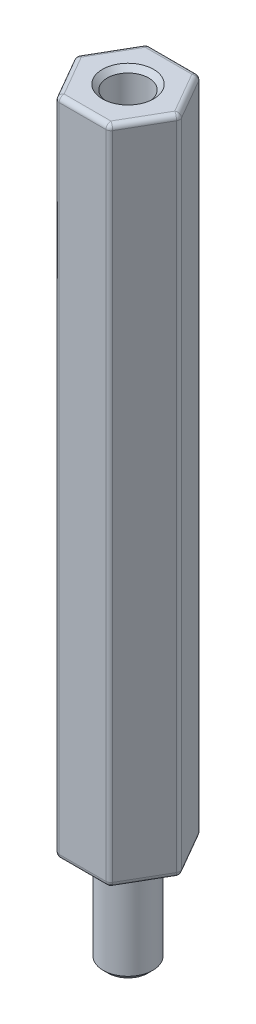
ISO-10303-21;
HEADER;
FILE_DESCRIPTION(('STEP AP214'),'2;1');
FILE_NAME('part.step','',(''),(''),'','','');
FILE_SCHEMA(('AUTOMOTIVE_DESIGN { 1 0 10303 214 1 1 1 1 }'));
ENDSEC;
DATA;
#1=APPLICATION_CONTEXT('core data for automotive mechanical design processes');
#2=APPLICATION_PROTOCOL_DEFINITION('international standard','automotive_design',2000,#1);
#3=PRODUCT_CONTEXT('',#1,'mechanical');
#4=PRODUCT('Part','Part','',(#3));
#5=PRODUCT_RELATED_PRODUCT_CATEGORY('part','',(#4));
#6=PRODUCT_DEFINITION_FORMATION('','',#4);
#7=PRODUCT_DEFINITION_CONTEXT('part definition',#1,'design');
#8=PRODUCT_DEFINITION('design','',#6,#7);
#9=PRODUCT_DEFINITION_SHAPE('','',#8);
#10=(LENGTH_UNIT() NAMED_UNIT(*) SI_UNIT(.MILLI.,.METRE.));
#11=(NAMED_UNIT(*) PLANE_ANGLE_UNIT() SI_UNIT($,.RADIAN.));
#12=(NAMED_UNIT(*) SI_UNIT($,.STERADIAN.) SOLID_ANGLE_UNIT());
#13=UNCERTAINTY_MEASURE_WITH_UNIT(LENGTH_MEASURE(1.E-05),#10,'distance_accuracy_value','');
#14=(GEOMETRIC_REPRESENTATION_CONTEXT(3) GLOBAL_UNCERTAINTY_ASSIGNED_CONTEXT((#13)) GLOBAL_UNIT_ASSIGNED_CONTEXT((#10,
#11,#12)) REPRESENTATION_CONTEXT('',''));
#15=CARTESIAN_POINT('',(0.,0.,0.));
#16=DIRECTION('',(0.,0.,1.));
#17=DIRECTION('',(1.,0.,0.));
#18=AXIS2_PLACEMENT_3D('',#15,#16,#17);
#19=CARTESIAN_POINT('',(0.,40.,0.));
#20=DIRECTION('',(0.,1.,0.));
#21=DIRECTION('',(0.,0.,1.));
#22=AXIS2_PLACEMENT_3D('',#19,#20,#21);
#23=PLANE('',#22);
#24=CARTESIAN_POINT('',(0.,40.,0.));
#25=DIRECTION('',(0.,1.,0.));
#26=DIRECTION('',(0.,0.,1.));
#27=AXIS2_PLACEMENT_3D('',#24,#25,#26);
#28=CIRCLE('',#27,1.55000000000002);
#29=CARTESIAN_POINT('',(0.,40.,1.55000000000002));
#30=VERTEX_POINT('',#29);
#31=EDGE_CURVE('E288',#30,#30,#28,.F.);
#32=ORIENTED_EDGE('',*,*,#31,.T.);
#33=EDGE_LOOP('',(#32));
#34=FACE_BOUND('',#33,.T.);
#35=DIRECTION('',(-0.5,0.,0.866025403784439));
#36=VECTOR('',#35,1.);
#37=CARTESIAN_POINT('',(-2.82901631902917,40.,0.));
#38=LINE('',#37,#36);
#39=CARTESIAN_POINT('',(-1.41450815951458,40.,-2.45));
#40=VERTEX_POINT('',#39);
#41=CARTESIAN_POINT('',(-2.82901631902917,40.,0.));
#42=VERTEX_POINT('',#41);
#43=EDGE_CURVE('E62',#40,#42,#38,.T.);
#44=ORIENTED_EDGE('',*,*,#43,.T.);
#45=DIRECTION('',(0.5,0.,0.866025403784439));
#46=VECTOR('',#45,1.);
#47=CARTESIAN_POINT('',(-1.41450815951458,40.,2.45));
#48=LINE('',#47,#46);
#49=CARTESIAN_POINT('',(-1.41450815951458,40.,2.45));
#50=VERTEX_POINT('',#49);
#51=EDGE_CURVE('E571',#42,#50,#48,.T.);
#52=ORIENTED_EDGE('',*,*,#51,.T.);
#53=DIRECTION('',(1.,0.,0.));
#54=VECTOR('',#53,1.);
#55=CARTESIAN_POINT('',(1.41450815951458,40.,2.45));
#56=LINE('',#55,#54);
#57=CARTESIAN_POINT('',(1.41450815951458,40.,2.45));
#58=VERTEX_POINT('',#57);
#59=EDGE_CURVE('E563',#50,#58,#56,.T.);
#60=ORIENTED_EDGE('',*,*,#59,.T.);
#61=DIRECTION('',(0.5,0.,-0.866025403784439));
#62=VECTOR('',#61,1.);
#63=CARTESIAN_POINT('',(2.82901631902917,40.,0.));
#64=LINE('',#63,#62);
#65=CARTESIAN_POINT('',(2.82901631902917,40.,0.));
#66=VERTEX_POINT('',#65);
#67=EDGE_CURVE('E565',#58,#66,#64,.T.);
#68=ORIENTED_EDGE('',*,*,#67,.T.);
#69=DIRECTION('',(-0.5,0.,-0.866025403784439));
#70=VECTOR('',#69,1.);
#71=CARTESIAN_POINT('',(1.41450815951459,40.,-2.45));
#72=LINE('',#71,#70);
#73=CARTESIAN_POINT('',(1.41450815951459,40.,-2.45));
#74=VERTEX_POINT('',#73);
#75=EDGE_CURVE('E567',#66,#74,#72,.T.);
#76=ORIENTED_EDGE('',*,*,#75,.T.);
#77=DIRECTION('',(-1.,0.,0.));
#78=VECTOR('',#77,1.);
#79=CARTESIAN_POINT('',(-1.41450815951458,40.,-2.45));
#80=LINE('',#79,#78);
#81=EDGE_CURVE('E67',#74,#40,#80,.T.);
#82=ORIENTED_EDGE('',*,*,#81,.T.);
#83=EDGE_LOOP('',(#44,#52,#60,#68,#76,#82));
#84=FACE_BOUND('',#83,.T.);
#85=ADVANCED_FACE('F47',(#34,#84),#23,.T.);
#86=CARTESIAN_POINT('',(0.,0.,0.));
#87=DIRECTION('',(0.,1.,0.));
#88=DIRECTION('',(0.,0.,1.));
#89=AXIS2_PLACEMENT_3D('',#86,#87,#88);
#90=PLANE('',#89);
#91=CARTESIAN_POINT('',(0.,0.,0.));
#92=DIRECTION('',(0.,1.,0.));
#93=DIRECTION('',(0.,0.,1.));
#94=AXIS2_PLACEMENT_3D('',#91,#92,#93);
#95=CIRCLE('',#94,1.8);
#96=CARTESIAN_POINT('',(0.,0.,1.8));
#97=VERTEX_POINT('',#96);
#98=EDGE_CURVE('E11',#97,#97,#95,.T.);
#99=ORIENTED_EDGE('',*,*,#98,.T.);
#100=EDGE_LOOP('',(#99));
#101=FACE_BOUND('',#100,.T.);
#102=DIRECTION('',(1.,0.,0.));
#103=VECTOR('',#102,1.);
#104=CARTESIAN_POINT('',(0.,0.,2.45));
#105=LINE('',#104,#103);
#106=CARTESIAN_POINT('',(1.41450815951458,0.,2.45));
#107=VERTEX_POINT('',#106);
#108=CARTESIAN_POINT('',(-1.41450815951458,0.,2.45));
#109=VERTEX_POINT('',#108);
#110=EDGE_CURVE('E182',#107,#109,#105,.F.);
#111=ORIENTED_EDGE('',*,*,#110,.T.);
#112=DIRECTION('',(0.5,0.,0.866025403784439));
#113=VECTOR('',#112,1.);
#114=CARTESIAN_POINT('',(-2.12176223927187,0.,1.225));
#115=LINE('',#114,#113);
#116=CARTESIAN_POINT('',(-2.82901631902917,0.,0.));
#117=VERTEX_POINT('',#116);
#118=EDGE_CURVE('E208',#109,#117,#115,.F.);
#119=ORIENTED_EDGE('',*,*,#118,.T.);
#120=DIRECTION('',(-0.5,0.,0.866025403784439));
#121=VECTOR('',#120,1.);
#122=CARTESIAN_POINT('',(-2.12176223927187,0.,-1.225));
#123=LINE('',#122,#121);
#124=CARTESIAN_POINT('',(-1.41450815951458,0.,-2.45));
#125=VERTEX_POINT('',#124);
#126=EDGE_CURVE('E524',#117,#125,#123,.F.);
#127=ORIENTED_EDGE('',*,*,#126,.T.);
#128=DIRECTION('',(-1.,0.,0.));
#129=VECTOR('',#128,1.);
#130=CARTESIAN_POINT('',(0.,0.,-2.45));
#131=LINE('',#130,#129);
#132=CARTESIAN_POINT('',(1.41450815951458,0.,-2.45));
#133=VERTEX_POINT('',#132);
#134=EDGE_CURVE('E522',#125,#133,#131,.F.);
#135=ORIENTED_EDGE('',*,*,#134,.T.);
#136=DIRECTION('',(-0.5,0.,-0.866025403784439));
#137=VECTOR('',#136,1.);
#138=CARTESIAN_POINT('',(2.12176223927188,0.,-1.225));
#139=LINE('',#138,#137);
#140=CARTESIAN_POINT('',(2.82901631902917,0.,0.));
#141=VERTEX_POINT('',#140);
#142=EDGE_CURVE('E520',#133,#141,#139,.F.);
#143=ORIENTED_EDGE('',*,*,#142,.T.);
#144=DIRECTION('',(0.5,0.,-0.866025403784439));
#145=VECTOR('',#144,1.);
#146=CARTESIAN_POINT('',(2.12176223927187,0.,1.225));
#147=LINE('',#146,#145);
#148=EDGE_CURVE('E518',#141,#107,#147,.F.);
#149=ORIENTED_EDGE('',*,*,#148,.T.);
#150=EDGE_LOOP('',(#111,#119,#127,#135,#143,#149));
#151=FACE_BOUND('',#150,.T.);
#152=ADVANCED_FACE('F307',(#101,#151),#90,.F.);
#153=CARTESIAN_POINT('',(1.58771324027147,40.,-2.75));
#154=DIRECTION('',(0.,0.,1.));
#155=DIRECTION('',(1.,0.,0.));
#156=AXIS2_PLACEMENT_3D('',#153,#154,#155);
#157=PLANE('',#156);
#158=DIRECTION('',(0.,-1.,0.));
#159=VECTOR('',#158,1.);
#160=CARTESIAN_POINT('',(1.41450815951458,40.,-2.75));
#161=LINE('',#160,#159);
#162=CARTESIAN_POINT('',(1.41450815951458,39.7,-2.75));
#163=VERTEX_POINT('',#162);
#164=CARTESIAN_POINT('',(1.41450815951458,0.300000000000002,-2.75));
#165=VERTEX_POINT('',#164);
#166=EDGE_CURVE('E487',#163,#165,#161,.T.);
#167=ORIENTED_EDGE('',*,*,#166,.T.);
#168=DIRECTION('',(-1.,0.,0.));
#169=VECTOR('',#168,1.);
#170=CARTESIAN_POINT('',(1.58771324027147,0.300000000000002,-2.75));
#171=LINE('',#170,#169);
#172=CARTESIAN_POINT('',(-1.41450815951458,0.300000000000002,-2.75));
#173=VERTEX_POINT('',#172);
#174=EDGE_CURVE('E541',#165,#173,#171,.T.);
#175=ORIENTED_EDGE('',*,*,#174,.T.);
#176=DIRECTION('',(0.,-1.,0.));
#177=VECTOR('',#176,1.);
#178=CARTESIAN_POINT('',(-1.41450815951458,40.,-2.75));
#179=LINE('',#178,#177);
#180=CARTESIAN_POINT('',(-1.41450815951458,39.7,-2.75));
#181=VERTEX_POINT('',#180);
#182=EDGE_CURVE('E484',#173,#181,#179,.F.);
#183=ORIENTED_EDGE('',*,*,#182,.T.);
#184=DIRECTION('',(-1.,0.,0.));
#185=VECTOR('',#184,1.);
#186=CARTESIAN_POINT('',(1.41450815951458,39.7,-2.75));
#187=LINE('',#186,#185);
#188=EDGE_CURVE('E539',#181,#163,#187,.F.);
#189=ORIENTED_EDGE('',*,*,#188,.T.);
#190=EDGE_LOOP('',(#167,#175,#183,#189));
#191=FACE_BOUND('',#190,.T.);
#192=ADVANCED_FACE('F315',(#191),#157,.F.);
#193=CARTESIAN_POINT('',(-1.58771324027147,40.,-2.75));
#194=DIRECTION('',(0.866025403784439,0.,0.5));
#195=DIRECTION('',(0.5,0.,-0.866025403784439));
#196=AXIS2_PLACEMENT_3D('',#193,#194,#195);
#197=PLANE('',#196);
#198=DIRECTION('',(0.,-1.,0.));
#199=VECTOR('',#198,1.);
#200=CARTESIAN_POINT('',(-1.67431578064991,40.,-2.6));
#201=LINE('',#200,#199);
#202=CARTESIAN_POINT('',(-1.67431578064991,39.7,-2.6));
#203=VERTEX_POINT('',#202);
#204=CARTESIAN_POINT('',(-1.67431578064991,0.300000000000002,-2.6));
#205=VERTEX_POINT('',#204);
#206=EDGE_CURVE('E195',#203,#205,#201,.T.);
#207=ORIENTED_EDGE('',*,*,#206,.T.);
#208=DIRECTION('',(-0.5,0.,0.866025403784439));
#209=VECTOR('',#208,1.);
#210=CARTESIAN_POINT('',(-1.58771324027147,0.300000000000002,-2.75));
#211=LINE('',#210,#209);
#212=CARTESIAN_POINT('',(-3.0888239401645,0.300000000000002,-0.15));
#213=VERTEX_POINT('',#212);
#214=EDGE_CURVE('E533',#205,#213,#211,.T.);
#215=ORIENTED_EDGE('',*,*,#214,.T.);
#216=DIRECTION('',(0.,-1.,0.));
#217=VECTOR('',#216,1.);
#218=CARTESIAN_POINT('',(-3.0888239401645,40.,-0.15));
#219=LINE('',#218,#217);
#220=CARTESIAN_POINT('',(-3.0888239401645,39.7,-0.15));
#221=VERTEX_POINT('',#220);
#222=EDGE_CURVE('E504',#213,#221,#219,.F.);
#223=ORIENTED_EDGE('',*,*,#222,.T.);
#224=DIRECTION('',(-0.5,0.,0.866025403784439));
#225=VECTOR('',#224,1.);
#226=CARTESIAN_POINT('',(-1.67431578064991,39.7,-2.6));
#227=LINE('',#226,#225);
#228=EDGE_CURVE('E531',#221,#203,#227,.F.);
#229=ORIENTED_EDGE('',*,*,#228,.T.);
#230=EDGE_LOOP('',(#207,#215,#223,#229));
#231=FACE_BOUND('',#230,.T.);
#232=ADVANCED_FACE('F336',(#231),#197,.F.);
#233=CARTESIAN_POINT('',(-3.17542648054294,40.,0.));
#234=DIRECTION('',(0.866025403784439,0.,-0.5));
#235=DIRECTION('',(-0.5,0.,-0.866025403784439));
#236=AXIS2_PLACEMENT_3D('',#233,#234,#235);
#237=PLANE('',#236);
#238=DIRECTION('',(0.,-1.,0.));
#239=VECTOR('',#238,1.);
#240=CARTESIAN_POINT('',(-3.0888239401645,40.,0.149999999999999));
#241=LINE('',#240,#239);
#242=CARTESIAN_POINT('',(-3.0888239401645,39.7,0.149999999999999));
#243=VERTEX_POINT('',#242);
#244=CARTESIAN_POINT('',(-3.0888239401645,0.300000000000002,0.149999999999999));
#245=VERTEX_POINT('',#244);
#246=EDGE_CURVE('E178',#243,#245,#241,.T.);
#247=ORIENTED_EDGE('',*,*,#246,.T.);
#248=DIRECTION('',(0.5,0.,0.866025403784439));
#249=VECTOR('',#248,1.);
#250=CARTESIAN_POINT('',(-3.17542648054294,0.300000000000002,0.));
#251=LINE('',#250,#249);
#252=CARTESIAN_POINT('',(-1.67431578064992,0.300000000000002,2.6));
#253=VERTEX_POINT('',#252);
#254=EDGE_CURVE('E173',#245,#253,#251,.T.);
#255=ORIENTED_EDGE('',*,*,#254,.T.);
#256=DIRECTION('',(0.,-1.,0.));
#257=VECTOR('',#256,1.);
#258=CARTESIAN_POINT('',(-1.67431578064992,40.,2.6));
#259=LINE('',#258,#257);
#260=CARTESIAN_POINT('',(-1.67431578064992,39.7,2.6));
#261=VERTEX_POINT('',#260);
#262=EDGE_CURVE('E176',#253,#261,#259,.F.);
#263=ORIENTED_EDGE('',*,*,#262,.T.);
#264=DIRECTION('',(0.5,0.,0.866025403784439));
#265=VECTOR('',#264,1.);
#266=CARTESIAN_POINT('',(-3.0888239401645,39.7,0.149999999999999));
#267=LINE('',#266,#265);
#268=EDGE_CURVE('E183',#261,#243,#267,.F.);
#269=ORIENTED_EDGE('',*,*,#268,.T.);
#270=EDGE_LOOP('',(#247,#255,#263,#269));
#271=FACE_BOUND('',#270,.T.);
#272=ADVANCED_FACE('F175',(#271),#237,.F.);
#273=CARTESIAN_POINT('',(-1.58771324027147,40.,2.75));
#274=DIRECTION('',(0.,0.,-1.));
#275=DIRECTION('',(-1.,0.,0.));
#276=AXIS2_PLACEMENT_3D('',#273,#274,#275);
#277=PLANE('',#276);
#278=DIRECTION('',(0.,-1.,0.));
#279=VECTOR('',#278,1.);
#280=CARTESIAN_POINT('',(-1.41450815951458,40.,2.75));
#281=LINE('',#280,#279);
#282=CARTESIAN_POINT('',(-1.41450815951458,39.7,2.75));
#283=VERTEX_POINT('',#282);
#284=CARTESIAN_POINT('',(-1.41450815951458,0.300000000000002,2.75));
#285=VERTEX_POINT('',#284);
#286=EDGE_CURVE('E513',#283,#285,#281,.T.);
#287=ORIENTED_EDGE('',*,*,#286,.T.);
#288=DIRECTION('',(1.,0.,0.));
#289=VECTOR('',#288,1.);
#290=CARTESIAN_POINT('',(-1.58771324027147,0.300000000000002,2.75));
#291=LINE('',#290,#289);
#292=CARTESIAN_POINT('',(1.41450815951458,0.300000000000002,2.75));
#293=VERTEX_POINT('',#292);
#294=EDGE_CURVE('E217',#285,#293,#291,.T.);
#295=ORIENTED_EDGE('',*,*,#294,.T.);
#296=DIRECTION('',(0.,-1.,0.));
#297=VECTOR('',#296,1.);
#298=CARTESIAN_POINT('',(1.41450815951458,40.,2.75));
#299=LINE('',#298,#297);
#300=CARTESIAN_POINT('',(1.41450815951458,39.7,2.75));
#301=VERTEX_POINT('',#300);
#302=EDGE_CURVE('E510',#293,#301,#299,.F.);
#303=ORIENTED_EDGE('',*,*,#302,.T.);
#304=DIRECTION('',(1.,0.,0.));
#305=VECTOR('',#304,1.);
#306=CARTESIAN_POINT('',(-1.41450815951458,39.7,2.75));
#307=LINE('',#306,#305);
#308=EDGE_CURVE('E572',#301,#283,#307,.F.);
#309=ORIENTED_EDGE('',*,*,#308,.T.);
#310=EDGE_LOOP('',(#287,#295,#303,#309));
#311=FACE_BOUND('',#310,.T.);
#312=ADVANCED_FACE('F329',(#311),#277,.F.);
#313=CARTESIAN_POINT('',(1.58771324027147,40.,2.75));
#314=DIRECTION('',(-0.866025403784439,0.,-0.5));
#315=DIRECTION('',(-0.5,0.,0.866025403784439));
#316=AXIS2_PLACEMENT_3D('',#313,#314,#315);
#317=PLANE('',#316);
#318=DIRECTION('',(0.,-1.,0.));
#319=VECTOR('',#318,1.);
#320=CARTESIAN_POINT('',(1.67431578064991,40.,2.6));
#321=LINE('',#320,#319);
#322=CARTESIAN_POINT('',(1.67431578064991,39.7,2.6));
#323=VERTEX_POINT('',#322);
#324=CARTESIAN_POINT('',(1.67431578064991,0.300000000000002,2.6));
#325=VERTEX_POINT('',#324);
#326=EDGE_CURVE('E498',#323,#325,#321,.T.);
#327=ORIENTED_EDGE('',*,*,#326,.T.);
#328=DIRECTION('',(0.5,0.,-0.866025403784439));
#329=VECTOR('',#328,1.);
#330=CARTESIAN_POINT('',(1.58771324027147,0.300000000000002,2.75));
#331=LINE('',#330,#329);
#332=CARTESIAN_POINT('',(3.0888239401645,0.300000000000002,0.149999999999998));
#333=VERTEX_POINT('',#332);
#334=EDGE_CURVE('E557',#325,#333,#331,.T.);
#335=ORIENTED_EDGE('',*,*,#334,.T.);
#336=DIRECTION('',(0.,-1.,0.));
#337=VECTOR('',#336,1.);
#338=CARTESIAN_POINT('',(3.0888239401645,40.,0.149999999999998));
#339=LINE('',#338,#337);
#340=CARTESIAN_POINT('',(3.0888239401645,39.7,0.149999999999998));
#341=VERTEX_POINT('',#340);
#342=EDGE_CURVE('E501',#333,#341,#339,.F.);
#343=ORIENTED_EDGE('',*,*,#342,.T.);
#344=DIRECTION('',(0.5,0.,-0.866025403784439));
#345=VECTOR('',#344,1.);
#346=CARTESIAN_POINT('',(1.67431578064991,39.7,2.6));
#347=LINE('',#346,#345);
#348=EDGE_CURVE('E555',#341,#323,#347,.F.);
#349=ORIENTED_EDGE('',*,*,#348,.T.);
#350=EDGE_LOOP('',(#327,#335,#343,#349));
#351=FACE_BOUND('',#350,.T.);
#352=ADVANCED_FACE('F325',(#351),#317,.F.);
#353=CARTESIAN_POINT('',(3.17542648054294,40.,0.));
#354=DIRECTION('',(-0.866025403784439,0.,0.5));
#355=DIRECTION('',(0.5,0.,0.866025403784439));
#356=AXIS2_PLACEMENT_3D('',#353,#354,#355);
#357=PLANE('',#356);
#358=DIRECTION('',(0.,-1.,0.));
#359=VECTOR('',#358,1.);
#360=CARTESIAN_POINT('',(3.0888239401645,40.,-0.150000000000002));
#361=LINE('',#360,#359);
#362=CARTESIAN_POINT('',(3.0888239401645,39.7,-0.150000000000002));
#363=VERTEX_POINT('',#362);
#364=CARTESIAN_POINT('',(3.0888239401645,0.300000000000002,-0.150000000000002));
#365=VERTEX_POINT('',#364);
#366=EDGE_CURVE('E492',#363,#365,#361,.T.);
#367=ORIENTED_EDGE('',*,*,#366,.T.);
#368=DIRECTION('',(-0.5,0.,-0.866025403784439));
#369=VECTOR('',#368,1.);
#370=CARTESIAN_POINT('',(3.17542648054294,0.300000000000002,0.));
#371=LINE('',#370,#369);
#372=CARTESIAN_POINT('',(1.67431578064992,0.300000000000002,-2.6));
#373=VERTEX_POINT('',#372);
#374=EDGE_CURVE('E549',#365,#373,#371,.T.);
#375=ORIENTED_EDGE('',*,*,#374,.T.);
#376=DIRECTION('',(0.,-1.,0.));
#377=VECTOR('',#376,1.);
#378=CARTESIAN_POINT('',(1.67431578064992,40.,-2.6));
#379=LINE('',#378,#377);
#380=CARTESIAN_POINT('',(1.67431578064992,39.7,-2.6));
#381=VERTEX_POINT('',#380);
#382=EDGE_CURVE('E495',#373,#381,#379,.F.);
#383=ORIENTED_EDGE('',*,*,#382,.T.);
#384=DIRECTION('',(-0.5,0.,-0.866025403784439));
#385=VECTOR('',#384,1.);
#386=CARTESIAN_POINT('',(3.0888239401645,39.7,-0.150000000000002));
#387=LINE('',#386,#385);
#388=EDGE_CURVE('E547',#381,#363,#387,.F.);
#389=ORIENTED_EDGE('',*,*,#388,.T.);
#390=EDGE_LOOP('',(#367,#375,#383,#389));
#391=FACE_BOUND('',#390,.T.);
#392=ADVANCED_FACE('F322',(#391),#357,.F.);
#393=CARTESIAN_POINT('',(0.,40.,0.));
#394=DIRECTION('',(0.,-1.,0.));
#395=DIRECTION('',(0.,0.,-1.));
#396=AXIS2_PLACEMENT_3D('',#393,#394,#395);
#397=CYLINDRICAL_SURFACE('',#396,1.25);
#398=CARTESIAN_POINT('',(0.,39.7,0.));
#399=DIRECTION('',(0.,1.,0.));
#400=DIRECTION('',(0.,0.,1.));
#401=AXIS2_PLACEMENT_3D('',#398,#399,#400);
#402=CIRCLE('',#401,1.25);
#403=CARTESIAN_POINT('',(0.,39.7,1.25));
#404=VERTEX_POINT('',#403);
#405=EDGE_CURVE('E285',#404,#404,#402,.T.);
#406=ORIENTED_EDGE('',*,*,#405,.T.);
#407=EDGE_LOOP('',(#406));
#408=FACE_BOUND('',#407,.T.);
#409=CARTESIAN_POINT('',(0.,0.,0.));
#410=DIRECTION('',(0.,1.,0.));
#411=DIRECTION('',(0.,0.,1.));
#412=AXIS2_PLACEMENT_3D('',#409,#410,#411);
#413=CIRCLE('',#412,1.25);
#414=CARTESIAN_POINT('',(0.,0.,1.25));
#415=VERTEX_POINT('',#414);
#416=EDGE_CURVE('E248',#415,#415,#413,.T.);
#417=ORIENTED_EDGE('',*,*,#416,.F.);
#418=EDGE_LOOP('',(#417));
#419=FACE_BOUND('',#418,.T.);
#420=ADVANCED_FACE('F319',(#408,#419),#397,.F.);
#421=CARTESIAN_POINT('',(1.41450815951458,40.,-2.45));
#422=DIRECTION('',(0.,-1.,0.));
#423=DIRECTION('',(0.,0.,-1.));
#424=AXIS2_PLACEMENT_3D('',#421,#422,#423);
#425=CYLINDRICAL_SURFACE('',#424,0.3);
#426=ORIENTED_EDGE('',*,*,#382,.F.);
#427=CARTESIAN_POINT('',(1.41450815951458,0.300000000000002,-2.45));
#428=DIRECTION('',(0.,-1.,0.));
#429=DIRECTION('',(0.,0.,-1.));
#430=AXIS2_PLACEMENT_3D('',#427,#428,#429);
#431=CIRCLE('',#430,0.3);
#432=EDGE_CURVE('E545',#373,#165,#431,.F.);
#433=ORIENTED_EDGE('',*,*,#432,.T.);
#434=ORIENTED_EDGE('',*,*,#166,.F.);
#435=CARTESIAN_POINT('',(1.41450815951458,39.7,-2.45));
#436=DIRECTION('',(0.,-1.,0.));
#437=DIRECTION('',(0.,0.,-1.));
#438=AXIS2_PLACEMENT_3D('',#435,#436,#437);
#439=CIRCLE('',#438,0.3);
#440=EDGE_CURVE('E543',#163,#381,#439,.T.);
#441=ORIENTED_EDGE('',*,*,#440,.T.);
#442=EDGE_LOOP('',(#426,#433,#434,#441));
#443=FACE_BOUND('',#442,.T.);
#444=ADVANCED_FACE('F343',(#443),#425,.T.);
#445=CARTESIAN_POINT('',(2.82901631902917,40.,0.));
#446=DIRECTION('',(0.,-1.,0.));
#447=DIRECTION('',(0.,0.,-1.));
#448=AXIS2_PLACEMENT_3D('',#445,#446,#447);
#449=CYLINDRICAL_SURFACE('',#448,0.3);
#450=ORIENTED_EDGE('',*,*,#342,.F.);
#451=CARTESIAN_POINT('',(2.82901631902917,0.300000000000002,0.));
#452=DIRECTION('',(0.,-1.,0.));
#453=DIRECTION('',(0.,0.,-1.));
#454=AXIS2_PLACEMENT_3D('',#451,#452,#453);
#455=CIRCLE('',#454,0.3);
#456=EDGE_CURVE('E553',#333,#365,#455,.F.);
#457=ORIENTED_EDGE('',*,*,#456,.T.);
#458=ORIENTED_EDGE('',*,*,#366,.F.);
#459=CARTESIAN_POINT('',(2.82901631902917,39.7,0.));
#460=DIRECTION('',(0.,-1.,0.));
#461=DIRECTION('',(0.,0.,-1.));
#462=AXIS2_PLACEMENT_3D('',#459,#460,#461);
#463=CIRCLE('',#462,0.3);
#464=EDGE_CURVE('E551',#363,#341,#463,.T.);
#465=ORIENTED_EDGE('',*,*,#464,.T.);
#466=EDGE_LOOP('',(#450,#457,#458,#465));
#467=FACE_BOUND('',#466,.T.);
#468=ADVANCED_FACE('F346',(#467),#449,.T.);
#469=CARTESIAN_POINT('',(-1.41450815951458,40.,-2.45));
#470=DIRECTION('',(0.,-1.,0.));
#471=DIRECTION('',(0.,0.,-1.));
#472=AXIS2_PLACEMENT_3D('',#469,#470,#471);
#473=CYLINDRICAL_SURFACE('',#472,0.3);
#474=ORIENTED_EDGE('',*,*,#182,.F.);
#475=CARTESIAN_POINT('',(-1.41450815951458,0.300000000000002,-2.45));
#476=DIRECTION('',(0.,-1.,0.));
#477=DIRECTION('',(0.,0.,-1.));
#478=AXIS2_PLACEMENT_3D('',#475,#476,#477);
#479=CIRCLE('',#478,0.3);
#480=EDGE_CURVE('E537',#173,#205,#479,.F.);
#481=ORIENTED_EDGE('',*,*,#480,.T.);
#482=ORIENTED_EDGE('',*,*,#206,.F.);
#483=CARTESIAN_POINT('',(-1.41450815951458,39.7,-2.45));
#484=DIRECTION('',(0.,-1.,0.));
#485=DIRECTION('',(0.,0.,-1.));
#486=AXIS2_PLACEMENT_3D('',#483,#484,#485);
#487=CIRCLE('',#486,0.3);
#488=EDGE_CURVE('E535',#203,#181,#487,.T.);
#489=ORIENTED_EDGE('',*,*,#488,.T.);
#490=EDGE_LOOP('',(#474,#481,#482,#489));
#491=FACE_BOUND('',#490,.T.);
#492=ADVANCED_FACE('F350',(#491),#473,.T.);
#493=CARTESIAN_POINT('',(-2.82901631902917,40.,0.));
#494=DIRECTION('',(0.,-1.,0.));
#495=DIRECTION('',(0.,0.,-1.));
#496=AXIS2_PLACEMENT_3D('',#493,#494,#495);
#497=CYLINDRICAL_SURFACE('',#496,0.3);
#498=ORIENTED_EDGE('',*,*,#222,.F.);
#499=CARTESIAN_POINT('',(-2.82901631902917,0.300000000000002,0.));
#500=DIRECTION('',(0.,-1.,0.));
#501=DIRECTION('',(0.,0.,-1.));
#502=AXIS2_PLACEMENT_3D('',#499,#500,#501);
#503=CIRCLE('',#502,0.3);
#504=EDGE_CURVE('E529',#213,#245,#503,.F.);
#505=ORIENTED_EDGE('',*,*,#504,.T.);
#506=ORIENTED_EDGE('',*,*,#246,.F.);
#507=CARTESIAN_POINT('',(-2.82901631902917,39.7,0.));
#508=DIRECTION('',(0.,-1.,0.));
#509=DIRECTION('',(0.,0.,-1.));
#510=AXIS2_PLACEMENT_3D('',#507,#508,#509);
#511=CIRCLE('',#510,0.3);
#512=EDGE_CURVE('E527',#243,#221,#511,.T.);
#513=ORIENTED_EDGE('',*,*,#512,.T.);
#514=EDGE_LOOP('',(#498,#505,#506,#513));
#515=FACE_BOUND('',#514,.T.);
#516=ADVANCED_FACE('F354',(#515),#497,.T.);
#517=CARTESIAN_POINT('',(-1.41450815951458,40.,2.45));
#518=DIRECTION('',(0.,-1.,0.));
#519=DIRECTION('',(0.,0.,-1.));
#520=AXIS2_PLACEMENT_3D('',#517,#518,#519);
#521=CYLINDRICAL_SURFACE('',#520,0.3);
#522=ORIENTED_EDGE('',*,*,#262,.F.);
#523=CARTESIAN_POINT('',(-1.41450815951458,0.300000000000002,2.45));
#524=DIRECTION('',(0.,-1.,0.));
#525=DIRECTION('',(0.,0.,-1.));
#526=AXIS2_PLACEMENT_3D('',#523,#524,#525);
#527=CIRCLE('',#526,0.3);
#528=EDGE_CURVE('E191',#253,#285,#527,.F.);
#529=ORIENTED_EDGE('',*,*,#528,.T.);
#530=ORIENTED_EDGE('',*,*,#286,.F.);
#531=CARTESIAN_POINT('',(-1.41450815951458,39.7,2.45));
#532=DIRECTION('',(0.,-1.,0.));
#533=DIRECTION('',(0.,0.,-1.));
#534=AXIS2_PLACEMENT_3D('',#531,#532,#533);
#535=CIRCLE('',#534,0.3);
#536=EDGE_CURVE('E194',#283,#261,#535,.T.);
#537=ORIENTED_EDGE('',*,*,#536,.T.);
#538=EDGE_LOOP('',(#522,#529,#530,#537));
#539=FACE_BOUND('',#538,.T.);
#540=ADVANCED_FACE('F189',(#539),#521,.T.);
#541=CARTESIAN_POINT('',(1.41450815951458,40.,2.45));
#542=DIRECTION('',(0.,-1.,0.));
#543=DIRECTION('',(0.,0.,-1.));
#544=AXIS2_PLACEMENT_3D('',#541,#542,#543);
#545=CYLINDRICAL_SURFACE('',#544,0.3);
#546=ORIENTED_EDGE('',*,*,#302,.F.);
#547=CARTESIAN_POINT('',(1.41450815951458,0.300000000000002,2.45));
#548=DIRECTION('',(0.,-1.,0.));
#549=DIRECTION('',(0.,0.,-1.));
#550=AXIS2_PLACEMENT_3D('',#547,#548,#549);
#551=CIRCLE('',#550,0.3);
#552=EDGE_CURVE('E561',#293,#325,#551,.F.);
#553=ORIENTED_EDGE('',*,*,#552,.T.);
#554=ORIENTED_EDGE('',*,*,#326,.F.);
#555=CARTESIAN_POINT('',(1.41450815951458,39.7,2.45));
#556=DIRECTION('',(0.,-1.,0.));
#557=DIRECTION('',(0.,0.,-1.));
#558=AXIS2_PLACEMENT_3D('',#555,#556,#557);
#559=CIRCLE('',#558,0.3);
#560=EDGE_CURVE('E559',#323,#301,#559,.T.);
#561=ORIENTED_EDGE('',*,*,#560,.T.);
#562=EDGE_LOOP('',(#546,#553,#554,#561));
#563=FACE_BOUND('',#562,.T.);
#564=ADVANCED_FACE('F361',(#563),#545,.T.);
#565=CARTESIAN_POINT('',(1.41450815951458,0.300000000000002,-2.45));
#566=DIRECTION('',(0.,1.,0.));
#567=DIRECTION('',(0.,0.,1.));
#568=AXIS2_PLACEMENT_3D('',#565,#566,#567);
#569=SPHERICAL_SURFACE('',#568,0.3);
#570=CARTESIAN_POINT('',(1.41450815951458,0.300000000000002,-2.45));
#571=DIRECTION('',(-1.,0.,0.));
#572=DIRECTION('',(0.,0.,1.));
#573=AXIS2_PLACEMENT_3D('',#570,#571,#572);
#574=CIRCLE('',#573,0.3);
#575=EDGE_CURVE('E242',#165,#133,#574,.T.);
#576=ORIENTED_EDGE('',*,*,#575,.F.);
#577=ORIENTED_EDGE('',*,*,#432,.F.);
#578=CARTESIAN_POINT('',(1.41450815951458,0.300000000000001,-2.45));
#579=DIRECTION('',(0.499999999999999,0.,0.866025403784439));
#580=DIRECTION('',(0.866025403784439,0.,-0.499999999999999));
#581=AXIS2_PLACEMENT_3D('',#578,#579,#580);
#582=CIRCLE('',#581,0.3);
#583=EDGE_CURVE('E245',#133,#373,#582,.T.);
#584=ORIENTED_EDGE('',*,*,#583,.F.);
#585=EDGE_LOOP('',(#576,#577,#584));
#586=FACE_BOUND('',#585,.T.);
#587=ADVANCED_FACE('F364',(#586),#569,.T.);
#588=CARTESIAN_POINT('',(2.91561885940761,0.300000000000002,0.149999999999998));
#589=DIRECTION('',(-0.5,0.,-0.866025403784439));
#590=DIRECTION('',(-0.866025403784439,0.,0.5));
#591=AXIS2_PLACEMENT_3D('',#588,#589,#590);
#592=CYLINDRICAL_SURFACE('',#591,0.3);
#593=ORIENTED_EDGE('',*,*,#583,.T.);
#594=ORIENTED_EDGE('',*,*,#374,.F.);
#595=CARTESIAN_POINT('',(2.82901631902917,0.3,0.));
#596=DIRECTION('',(0.5,0.,0.866025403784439));
#597=DIRECTION('',(0.866025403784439,0.,-0.5));
#598=AXIS2_PLACEMENT_3D('',#595,#596,#597);
#599=CIRCLE('',#598,0.3);
#600=EDGE_CURVE('E239',#141,#365,#599,.T.);
#601=ORIENTED_EDGE('',*,*,#600,.F.);
#602=ORIENTED_EDGE('',*,*,#142,.F.);
#603=EDGE_LOOP('',(#593,#594,#601,#602));
#604=FACE_BOUND('',#603,.T.);
#605=ADVANCED_FACE('F402',(#604),#592,.T.);
#606=CARTESIAN_POINT('',(1.58771324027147,0.300000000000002,-2.45));
#607=DIRECTION('',(-1.,0.,0.));
#608=DIRECTION('',(0.,0.,1.));
#609=AXIS2_PLACEMENT_3D('',#606,#607,#608);
#610=CYLINDRICAL_SURFACE('',#609,0.3);
#611=ORIENTED_EDGE('',*,*,#575,.T.);
#612=ORIENTED_EDGE('',*,*,#134,.F.);
#613=CARTESIAN_POINT('',(-1.41450815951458,0.300000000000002,-2.45));
#614=DIRECTION('',(-1.,0.,0.));
#615=DIRECTION('',(0.,-1.,0.));
#616=AXIS2_PLACEMENT_3D('',#613,#614,#615);
#617=CIRCLE('',#616,0.3);
#618=EDGE_CURVE('E236',#173,#125,#617,.T.);
#619=ORIENTED_EDGE('',*,*,#618,.F.);
#620=ORIENTED_EDGE('',*,*,#174,.F.);
#621=EDGE_LOOP('',(#611,#612,#619,#620));
#622=FACE_BOUND('',#621,.T.);
#623=ADVANCED_FACE('F398',(#622),#610,.T.);
#624=CARTESIAN_POINT('',(2.82901631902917,0.300000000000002,0.));
#625=DIRECTION('',(0.,1.,0.));
#626=DIRECTION('',(0.,0.,1.));
#627=AXIS2_PLACEMENT_3D('',#624,#625,#626);
#628=SPHERICAL_SURFACE('',#627,0.3);
#629=ORIENTED_EDGE('',*,*,#600,.T.);
#630=ORIENTED_EDGE('',*,*,#456,.F.);
#631=CARTESIAN_POINT('',(2.82901631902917,0.300000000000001,0.));
#632=DIRECTION('',(-0.5,0.,0.866025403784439));
#633=DIRECTION('',(0.866025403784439,0.,0.5));
#634=AXIS2_PLACEMENT_3D('',#631,#632,#633);
#635=CIRCLE('',#634,0.3);
#636=EDGE_CURVE('E233',#141,#333,#635,.T.);
#637=ORIENTED_EDGE('',*,*,#636,.F.);
#638=EDGE_LOOP('',(#629,#630,#637));
#639=FACE_BOUND('',#638,.T.);
#640=ADVANCED_FACE('F394',(#639),#628,.T.);
#641=CARTESIAN_POINT('',(-1.41450815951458,0.300000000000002,-2.45));
#642=DIRECTION('',(0.,1.,0.));
#643=DIRECTION('',(0.,0.,1.));
#644=AXIS2_PLACEMENT_3D('',#641,#642,#643);
#645=SPHERICAL_SURFACE('',#644,0.3);
#646=ORIENTED_EDGE('',*,*,#480,.F.);
#647=ORIENTED_EDGE('',*,*,#618,.T.);
#648=CARTESIAN_POINT('',(-1.41450815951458,0.300000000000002,-2.45));
#649=DIRECTION('',(-0.5,0.,0.866025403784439));
#650=DIRECTION('',(0.866025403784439,0.,0.5));
#651=AXIS2_PLACEMENT_3D('',#648,#649,#650);
#652=CIRCLE('',#651,0.3);
#653=EDGE_CURVE('E230',#205,#125,#652,.T.);
#654=ORIENTED_EDGE('',*,*,#653,.F.);
#655=EDGE_LOOP('',(#646,#647,#654));
#656=FACE_BOUND('',#655,.T.);
#657=ADVANCED_FACE('F390',(#656),#645,.T.);
#658=CARTESIAN_POINT('',(1.32790561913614,0.300000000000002,2.6));
#659=DIRECTION('',(0.5,0.,-0.866025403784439));
#660=DIRECTION('',(-0.866025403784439,0.,-0.5));
#661=AXIS2_PLACEMENT_3D('',#658,#659,#660);
#662=CYLINDRICAL_SURFACE('',#661,0.3);
#663=ORIENTED_EDGE('',*,*,#636,.T.);
#664=ORIENTED_EDGE('',*,*,#334,.F.);
#665=CARTESIAN_POINT('',(1.41450815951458,0.3,2.45));
#666=DIRECTION('',(-0.5,0.,0.866025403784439));
#667=DIRECTION('',(0.866025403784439,0.,0.5));
#668=AXIS2_PLACEMENT_3D('',#665,#666,#667);
#669=CIRCLE('',#668,0.3);
#670=EDGE_CURVE('E227',#107,#325,#669,.T.);
#671=ORIENTED_EDGE('',*,*,#670,.F.);
#672=ORIENTED_EDGE('',*,*,#148,.F.);
#673=EDGE_LOOP('',(#663,#664,#671,#672));
#674=FACE_BOUND('',#673,.T.);
#675=ADVANCED_FACE('F386',(#674),#662,.T.);
#676=CARTESIAN_POINT('',(-1.32790561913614,0.300000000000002,-2.6));
#677=DIRECTION('',(-0.5,0.,0.866025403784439));
#678=DIRECTION('',(0.866025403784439,0.,0.5));
#679=AXIS2_PLACEMENT_3D('',#676,#677,#678);
#680=CYLINDRICAL_SURFACE('',#679,0.3);
#681=ORIENTED_EDGE('',*,*,#653,.T.);
#682=ORIENTED_EDGE('',*,*,#126,.F.);
#683=CARTESIAN_POINT('',(-2.82901631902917,0.300000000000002,0.));
#684=DIRECTION('',(-0.5,0.,0.866025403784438));
#685=DIRECTION('',(0.866025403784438,0.,0.5));
#686=AXIS2_PLACEMENT_3D('',#683,#684,#685);
#687=CIRCLE('',#686,0.3);
#688=EDGE_CURVE('E224',#213,#117,#687,.T.);
#689=ORIENTED_EDGE('',*,*,#688,.F.);
#690=ORIENTED_EDGE('',*,*,#214,.F.);
#691=EDGE_LOOP('',(#681,#682,#689,#690));
#692=FACE_BOUND('',#691,.T.);
#693=ADVANCED_FACE('F382',(#692),#680,.T.);
#694=CARTESIAN_POINT('',(1.41450815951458,0.300000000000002,2.45));
#695=DIRECTION('',(0.,1.,0.));
#696=DIRECTION('',(0.,0.,1.));
#697=AXIS2_PLACEMENT_3D('',#694,#695,#696);
#698=SPHERICAL_SURFACE('',#697,0.3);
#699=ORIENTED_EDGE('',*,*,#670,.T.);
#700=ORIENTED_EDGE('',*,*,#552,.F.);
#701=CARTESIAN_POINT('',(1.41450815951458,0.300000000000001,2.45));
#702=DIRECTION('',(-1.,0.,0.));
#703=DIRECTION('',(0.,0.,1.));
#704=AXIS2_PLACEMENT_3D('',#701,#702,#703);
#705=CIRCLE('',#704,0.3);
#706=EDGE_CURVE('E221',#107,#293,#705,.T.);
#707=ORIENTED_EDGE('',*,*,#706,.F.);
#708=EDGE_LOOP('',(#699,#700,#707));
#709=FACE_BOUND('',#708,.T.);
#710=ADVANCED_FACE('F378',(#709),#698,.T.);
#711=CARTESIAN_POINT('',(-2.82901631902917,0.300000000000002,0.));
#712=DIRECTION('',(0.,1.,0.));
#713=DIRECTION('',(0.,0.,1.));
#714=AXIS2_PLACEMENT_3D('',#711,#712,#713);
#715=SPHERICAL_SURFACE('',#714,0.3);
#716=ORIENTED_EDGE('',*,*,#504,.F.);
#717=ORIENTED_EDGE('',*,*,#688,.T.);
#718=CARTESIAN_POINT('',(-2.82901631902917,0.300000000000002,0.));
#719=DIRECTION('',(0.5,0.,0.866025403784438));
#720=DIRECTION('',(0.866025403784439,0.,-0.5));
#721=AXIS2_PLACEMENT_3D('',#718,#719,#720);
#722=CIRCLE('',#721,0.3);
#723=EDGE_CURVE('E211',#245,#117,#722,.T.);
#724=ORIENTED_EDGE('',*,*,#723,.F.);
#725=EDGE_LOOP('',(#716,#717,#724));
#726=FACE_BOUND('',#725,.T.);
#727=ADVANCED_FACE('F374',(#726),#715,.T.);
#728=CARTESIAN_POINT('',(-1.58771324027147,0.300000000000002,2.45));
#729=DIRECTION('',(1.,0.,0.));
#730=DIRECTION('',(0.,0.,-1.));
#731=AXIS2_PLACEMENT_3D('',#728,#729,#730);
#732=CYLINDRICAL_SURFACE('',#731,0.3);
#733=ORIENTED_EDGE('',*,*,#706,.T.);
#734=ORIENTED_EDGE('',*,*,#294,.F.);
#735=CARTESIAN_POINT('',(-1.41450815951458,0.3,2.45));
#736=DIRECTION('',(-1.,0.,0.));
#737=DIRECTION('',(0.,0.,1.));
#738=AXIS2_PLACEMENT_3D('',#735,#736,#737);
#739=CIRCLE('',#738,0.3);
#740=EDGE_CURVE('E202',#109,#285,#739,.T.);
#741=ORIENTED_EDGE('',*,*,#740,.F.);
#742=ORIENTED_EDGE('',*,*,#110,.F.);
#743=EDGE_LOOP('',(#733,#734,#741,#742));
#744=FACE_BOUND('',#743,.T.);
#745=ADVANCED_FACE('F371',(#744),#732,.T.);
#746=CARTESIAN_POINT('',(-2.91561885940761,0.300000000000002,-0.150000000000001));
#747=DIRECTION('',(0.5,0.,0.866025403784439));
#748=DIRECTION('',(0.866025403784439,0.,-0.5));
#749=AXIS2_PLACEMENT_3D('',#746,#747,#748);
#750=CYLINDRICAL_SURFACE('',#749,0.3);
#751=ORIENTED_EDGE('',*,*,#723,.T.);
#752=ORIENTED_EDGE('',*,*,#118,.F.);
#753=CARTESIAN_POINT('',(-1.41450815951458,0.300000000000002,2.45));
#754=DIRECTION('',(0.5,0.,0.866025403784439));
#755=DIRECTION('',(0.866025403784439,0.,-0.5));
#756=AXIS2_PLACEMENT_3D('',#753,#754,#755);
#757=CIRCLE('',#756,0.3);
#758=EDGE_CURVE('E200',#253,#109,#757,.T.);
#759=ORIENTED_EDGE('',*,*,#758,.F.);
#760=ORIENTED_EDGE('',*,*,#254,.F.);
#761=EDGE_LOOP('',(#751,#752,#759,#760));
#762=FACE_BOUND('',#761,.T.);
#763=ADVANCED_FACE('F206',(#762),#750,.T.);
#764=CARTESIAN_POINT('',(-1.41450815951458,0.300000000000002,2.45));
#765=DIRECTION('',(0.,1.,0.));
#766=DIRECTION('',(0.,0.,1.));
#767=AXIS2_PLACEMENT_3D('',#764,#765,#766);
#768=SPHERICAL_SURFACE('',#767,0.3);
#769=ORIENTED_EDGE('',*,*,#740,.T.);
#770=ORIENTED_EDGE('',*,*,#528,.F.);
#771=ORIENTED_EDGE('',*,*,#758,.T.);
#772=EDGE_LOOP('',(#769,#770,#771));
#773=FACE_BOUND('',#772,.T.);
#774=ADVANCED_FACE('F199',(#773),#768,.T.);
#775=CARTESIAN_POINT('',(1.41450815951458,39.7,-2.45));
#776=DIRECTION('',(0.,1.,0.));
#777=DIRECTION('',(0.,0.,1.));
#778=AXIS2_PLACEMENT_3D('',#775,#776,#777);
#779=SPHERICAL_SURFACE('',#778,0.3);
#780=CARTESIAN_POINT('',(1.41450815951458,39.7,-2.45));
#781=DIRECTION('',(0.499999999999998,0.,0.86602540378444));
#782=DIRECTION('',(0.86602540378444,0.,-0.499999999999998));
#783=AXIS2_PLACEMENT_3D('',#780,#781,#782);
#784=CIRCLE('',#783,0.3);
#785=EDGE_CURVE('E214',#381,#74,#784,.T.);
#786=ORIENTED_EDGE('',*,*,#785,.F.);
#787=ORIENTED_EDGE('',*,*,#440,.F.);
#788=CARTESIAN_POINT('',(1.41450815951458,39.7,-2.45));
#789=DIRECTION('',(-1.,0.,0.));
#790=DIRECTION('',(0.,0.,1.));
#791=AXIS2_PLACEMENT_3D('',#788,#789,#790);
#792=CIRCLE('',#791,0.3);
#793=EDGE_CURVE('E209',#74,#163,#792,.T.);
#794=ORIENTED_EDGE('',*,*,#793,.F.);
#795=EDGE_LOOP('',(#786,#787,#794));
#796=FACE_BOUND('',#795,.T.);
#797=ADVANCED_FACE('F368',(#796),#779,.T.);
#798=CARTESIAN_POINT('',(0.,39.7,-2.45));
#799=DIRECTION('',(1.,0.,0.));
#800=DIRECTION('',(0.,0.,-1.));
#801=AXIS2_PLACEMENT_3D('',#798,#799,#800);
#802=CYLINDRICAL_SURFACE('',#801,0.3);
#803=ORIENTED_EDGE('',*,*,#793,.T.);
#804=ORIENTED_EDGE('',*,*,#188,.F.);
#805=CARTESIAN_POINT('',(-1.41450815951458,39.7,-2.45));
#806=DIRECTION('',(-1.,0.,0.));
#807=DIRECTION('',(0.,0.,1.));
#808=AXIS2_PLACEMENT_3D('',#805,#806,#807);
#809=CIRCLE('',#808,0.3);
#810=EDGE_CURVE('E274',#40,#181,#809,.T.);
#811=ORIENTED_EDGE('',*,*,#810,.F.);
#812=ORIENTED_EDGE('',*,*,#81,.F.);
#813=EDGE_LOOP('',(#803,#804,#811,#812));
#814=FACE_BOUND('',#813,.T.);
#815=ADVANCED_FACE('F450',(#814),#802,.T.);
#816=CARTESIAN_POINT('',(2.12176223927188,39.7,-1.225));
#817=DIRECTION('',(0.5,0.,0.866025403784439));
#818=DIRECTION('',(0.866025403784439,0.,-0.5));
#819=AXIS2_PLACEMENT_3D('',#816,#817,#818);
#820=CYLINDRICAL_SURFACE('',#819,0.3);
#821=ORIENTED_EDGE('',*,*,#785,.T.);
#822=ORIENTED_EDGE('',*,*,#75,.F.);
#823=CARTESIAN_POINT('',(2.82901631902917,39.7,0.));
#824=DIRECTION('',(0.5,0.,0.866025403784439));
#825=DIRECTION('',(0.866025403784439,0.,-0.5));
#826=AXIS2_PLACEMENT_3D('',#823,#824,#825);
#827=CIRCLE('',#826,0.3);
#828=EDGE_CURVE('E271',#363,#66,#827,.T.);
#829=ORIENTED_EDGE('',*,*,#828,.F.);
#830=ORIENTED_EDGE('',*,*,#388,.F.);
#831=EDGE_LOOP('',(#821,#822,#829,#830));
#832=FACE_BOUND('',#831,.T.);
#833=ADVANCED_FACE('F446',(#832),#820,.T.);
#834=CARTESIAN_POINT('',(-1.41450815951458,39.7,-2.45));
#835=DIRECTION('',(0.,1.,0.));
#836=DIRECTION('',(0.,0.,1.));
#837=AXIS2_PLACEMENT_3D('',#834,#835,#836);
#838=SPHERICAL_SURFACE('',#837,0.3);
#839=ORIENTED_EDGE('',*,*,#810,.T.);
#840=ORIENTED_EDGE('',*,*,#488,.F.);
#841=CARTESIAN_POINT('',(-1.41450815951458,39.7,-2.45));
#842=DIRECTION('',(-0.5,0.,0.866025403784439));
#843=DIRECTION('',(0.866025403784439,0.,0.5));
#844=AXIS2_PLACEMENT_3D('',#841,#842,#843);
#845=CIRCLE('',#844,0.3);
#846=EDGE_CURVE('E268',#40,#203,#845,.T.);
#847=ORIENTED_EDGE('',*,*,#846,.F.);
#848=EDGE_LOOP('',(#839,#840,#847));
#849=FACE_BOUND('',#848,.T.);
#850=ADVANCED_FACE('F442',(#849),#838,.T.);
#851=CARTESIAN_POINT('',(2.82901631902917,39.7,0.));
#852=DIRECTION('',(0.,1.,0.));
#853=DIRECTION('',(0.,0.,1.));
#854=AXIS2_PLACEMENT_3D('',#851,#852,#853);
#855=SPHERICAL_SURFACE('',#854,0.3);
#856=ORIENTED_EDGE('',*,*,#464,.F.);
#857=ORIENTED_EDGE('',*,*,#828,.T.);
#858=CARTESIAN_POINT('',(2.82901631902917,39.7,0.));
#859=DIRECTION('',(-0.5,0.,0.866025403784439));
#860=DIRECTION('',(0.866025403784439,0.,0.5));
#861=AXIS2_PLACEMENT_3D('',#858,#859,#860);
#862=CIRCLE('',#861,0.3);
#863=EDGE_CURVE('E265',#341,#66,#862,.T.);
#864=ORIENTED_EDGE('',*,*,#863,.F.);
#865=EDGE_LOOP('',(#856,#857,#864));
#866=FACE_BOUND('',#865,.T.);
#867=ADVANCED_FACE('F438',(#866),#855,.T.);
#868=CARTESIAN_POINT('',(-2.12176223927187,39.7,-1.225));
#869=DIRECTION('',(0.5,0.,-0.866025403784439));
#870=DIRECTION('',(-0.866025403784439,0.,-0.5));
#871=AXIS2_PLACEMENT_3D('',#868,#869,#870);
#872=CYLINDRICAL_SURFACE('',#871,0.3);
#873=ORIENTED_EDGE('',*,*,#846,.T.);
#874=ORIENTED_EDGE('',*,*,#228,.F.);
#875=CARTESIAN_POINT('',(-2.82901631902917,39.7,0.));
#876=DIRECTION('',(-0.499999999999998,0.,0.86602540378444));
#877=DIRECTION('',(0.86602540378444,0.,0.499999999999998));
#878=AXIS2_PLACEMENT_3D('',#875,#876,#877);
#879=CIRCLE('',#878,0.3);
#880=EDGE_CURVE('E262',#42,#221,#879,.T.);
#881=ORIENTED_EDGE('',*,*,#880,.F.);
#882=ORIENTED_EDGE('',*,*,#43,.F.);
#883=EDGE_LOOP('',(#873,#874,#881,#882));
#884=FACE_BOUND('',#883,.T.);
#885=ADVANCED_FACE('F434',(#884),#872,.T.);
#886=CARTESIAN_POINT('',(2.12176223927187,39.7,1.225));
#887=DIRECTION('',(-0.5,0.,0.866025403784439));
#888=DIRECTION('',(0.866025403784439,0.,0.5));
#889=AXIS2_PLACEMENT_3D('',#886,#887,#888);
#890=CYLINDRICAL_SURFACE('',#889,0.3);
#891=ORIENTED_EDGE('',*,*,#863,.T.);
#892=ORIENTED_EDGE('',*,*,#67,.F.);
#893=CARTESIAN_POINT('',(1.41450815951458,39.7,2.45));
#894=DIRECTION('',(-0.5,0.,0.866025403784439));
#895=DIRECTION('',(0.866025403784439,0.,0.5));
#896=AXIS2_PLACEMENT_3D('',#893,#894,#895);
#897=CIRCLE('',#896,0.3);
#898=EDGE_CURVE('E259',#323,#58,#897,.T.);
#899=ORIENTED_EDGE('',*,*,#898,.F.);
#900=ORIENTED_EDGE('',*,*,#348,.F.);
#901=EDGE_LOOP('',(#891,#892,#899,#900));
#902=FACE_BOUND('',#901,.T.);
#903=ADVANCED_FACE('F430',(#902),#890,.T.);
#904=CARTESIAN_POINT('',(-2.82901631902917,39.7,0.));
#905=DIRECTION('',(0.,1.,0.));
#906=DIRECTION('',(0.,0.,1.));
#907=AXIS2_PLACEMENT_3D('',#904,#905,#906);
#908=SPHERICAL_SURFACE('',#907,0.3);
#909=ORIENTED_EDGE('',*,*,#880,.T.);
#910=ORIENTED_EDGE('',*,*,#512,.F.);
#911=CARTESIAN_POINT('',(-2.82901631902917,39.7,0.));
#912=DIRECTION('',(0.5,0.,0.866025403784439));
#913=DIRECTION('',(0.866025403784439,0.,-0.5));
#914=AXIS2_PLACEMENT_3D('',#911,#912,#913);
#915=CIRCLE('',#914,0.3);
#916=EDGE_CURVE('E256',#42,#243,#915,.T.);
#917=ORIENTED_EDGE('',*,*,#916,.F.);
#918=EDGE_LOOP('',(#909,#910,#917));
#919=FACE_BOUND('',#918,.T.);
#920=ADVANCED_FACE('F426',(#919),#908,.T.);
#921=CARTESIAN_POINT('',(1.41450815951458,39.7,2.45));
#922=DIRECTION('',(0.,1.,0.));
#923=DIRECTION('',(0.,0.,1.));
#924=AXIS2_PLACEMENT_3D('',#921,#922,#923);
#925=SPHERICAL_SURFACE('',#924,0.3);
#926=ORIENTED_EDGE('',*,*,#560,.F.);
#927=ORIENTED_EDGE('',*,*,#898,.T.);
#928=CARTESIAN_POINT('',(1.41450815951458,39.7,2.45));
#929=DIRECTION('',(-1.,0.,0.));
#930=DIRECTION('',(0.,0.,1.));
#931=AXIS2_PLACEMENT_3D('',#928,#929,#930);
#932=CIRCLE('',#931,0.3);
#933=EDGE_CURVE('E253',#301,#58,#932,.T.);
#934=ORIENTED_EDGE('',*,*,#933,.F.);
#935=EDGE_LOOP('',(#926,#927,#934));
#936=FACE_BOUND('',#935,.T.);
#937=ADVANCED_FACE('F422',(#936),#925,.T.);
#938=CARTESIAN_POINT('',(-2.12176223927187,39.7,1.225));
#939=DIRECTION('',(-0.5,0.,-0.866025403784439));
#940=DIRECTION('',(-0.866025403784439,0.,0.5));
#941=AXIS2_PLACEMENT_3D('',#938,#939,#940);
#942=CYLINDRICAL_SURFACE('',#941,0.3);
#943=ORIENTED_EDGE('',*,*,#916,.T.);
#944=ORIENTED_EDGE('',*,*,#268,.F.);
#945=CARTESIAN_POINT('',(-1.41450815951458,39.7,2.45));
#946=DIRECTION('',(0.5,0.,0.866025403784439));
#947=DIRECTION('',(0.866025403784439,0.,-0.5));
#948=AXIS2_PLACEMENT_3D('',#945,#946,#947);
#949=CIRCLE('',#948,0.3);
#950=EDGE_CURVE('E251',#50,#261,#949,.T.);
#951=ORIENTED_EDGE('',*,*,#950,.F.);
#952=ORIENTED_EDGE('',*,*,#51,.F.);
#953=EDGE_LOOP('',(#943,#944,#951,#952));
#954=FACE_BOUND('',#953,.T.);
#955=ADVANCED_FACE('F418',(#954),#942,.T.);
#956=CARTESIAN_POINT('',(0.,39.7,2.45));
#957=DIRECTION('',(-1.,0.,0.));
#958=DIRECTION('',(0.,0.,1.));
#959=AXIS2_PLACEMENT_3D('',#956,#957,#958);
#960=CYLINDRICAL_SURFACE('',#959,0.3);
#961=ORIENTED_EDGE('',*,*,#933,.T.);
#962=ORIENTED_EDGE('',*,*,#59,.F.);
#963=CARTESIAN_POINT('',(-1.41450815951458,39.7,2.45));
#964=DIRECTION('',(-1.,0.,0.));
#965=DIRECTION('',(0.,0.,1.));
#966=AXIS2_PLACEMENT_3D('',#963,#964,#965);
#967=CIRCLE('',#966,0.3);
#968=EDGE_CURVE('E249',#283,#50,#967,.T.);
#969=ORIENTED_EDGE('',*,*,#968,.F.);
#970=ORIENTED_EDGE('',*,*,#308,.F.);
#971=EDGE_LOOP('',(#961,#962,#969,#970));
#972=FACE_BOUND('',#971,.T.);
#973=ADVANCED_FACE('F414',(#972),#960,.T.);
#974=CARTESIAN_POINT('',(-1.41450815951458,39.7,2.45));
#975=DIRECTION('',(0.,1.,0.));
#976=DIRECTION('',(0.,0.,1.));
#977=AXIS2_PLACEMENT_3D('',#974,#975,#976);
#978=SPHERICAL_SURFACE('',#977,0.3);
#979=ORIENTED_EDGE('',*,*,#950,.T.);
#980=ORIENTED_EDGE('',*,*,#536,.F.);
#981=ORIENTED_EDGE('',*,*,#968,.T.);
#982=EDGE_LOOP('',(#979,#980,#981));
#983=FACE_BOUND('',#982,.T.);
#984=ADVANCED_FACE('F410',(#983),#978,.T.);
#985=CARTESIAN_POINT('',(0.,0.,0.));
#986=DIRECTION('',(0.,-1.,0.));
#987=DIRECTION('',(0.,0.,-1.));
#988=AXIS2_PLACEMENT_3D('',#985,#986,#987);
#989=PLANE('',#988);
#990=ORIENTED_EDGE('',*,*,#416,.T.);
#991=EDGE_LOOP('',(#990));
#992=FACE_BOUND('',#991,.T.);
#993=ADVANCED_FACE('F413',(#992),#989,.F.);
#994=CARTESIAN_POINT('',(0.,-6.,0.));
#995=DIRECTION('',(0.,1.,0.));
#996=DIRECTION('',(0.,0.,1.));
#997=AXIS2_PLACEMENT_3D('',#994,#995,#996);
#998=CYLINDRICAL_SURFACE('',#997,1.5);
#999=CARTESIAN_POINT('',(0.,-0.3,0.));
#1000=DIRECTION('',(0.,1.,0.));
#1001=DIRECTION('',(0.,0.,1.));
#1002=AXIS2_PLACEMENT_3D('',#999,#1000,#1001);
#1003=CIRCLE('',#1002,1.5);
#1004=CARTESIAN_POINT('',(0.,-0.3,1.5));
#1005=VERTEX_POINT('',#1004);
#1006=EDGE_CURVE('E55',#1005,#1005,#1003,.F.);
#1007=ORIENTED_EDGE('',*,*,#1006,.T.);
#1008=EDGE_LOOP('',(#1007));
#1009=FACE_BOUND('',#1008,.T.);
#1010=CARTESIAN_POINT('',(0.,-5.7,0.));
#1011=DIRECTION('',(0.,-1.,0.));
#1012=DIRECTION('',(0.,0.,-1.));
#1013=AXIS2_PLACEMENT_3D('',#1010,#1011,#1012);
#1014=CIRCLE('',#1013,1.5);
#1015=CARTESIAN_POINT('',(0.,-5.7,-1.5));
#1016=VERTEX_POINT('',#1015);
#1017=EDGE_CURVE('E282',#1016,#1016,#1014,.F.);
#1018=ORIENTED_EDGE('',*,*,#1017,.T.);
#1019=EDGE_LOOP('',(#1018));
#1020=FACE_BOUND('',#1019,.T.);
#1021=ADVANCED_FACE('F293',(#1009,#1020),#998,.T.);
#1022=CARTESIAN_POINT('',(0.,-6.,0.));
#1023=DIRECTION('',(0.,-1.,0.));
#1024=DIRECTION('',(0.,0.,-1.));
#1025=AXIS2_PLACEMENT_3D('',#1022,#1023,#1024);
#1026=PLANE('',#1025);
#1027=CARTESIAN_POINT('',(0.,-6.,0.));
#1028=DIRECTION('',(0.,-1.,0.));
#1029=DIRECTION('',(0.,0.,-1.));
#1030=AXIS2_PLACEMENT_3D('',#1027,#1028,#1029);
#1031=CIRCLE('',#1030,1.20000000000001);
#1032=CARTESIAN_POINT('',(0.,-6.,-1.20000000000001));
#1033=VERTEX_POINT('',#1032);
#1034=EDGE_CURVE('E279',#1033,#1033,#1031,.T.);
#1035=ORIENTED_EDGE('',*,*,#1034,.T.);
#1036=EDGE_LOOP('',(#1035));
#1037=FACE_BOUND('',#1036,.T.);
#1038=ADVANCED_FACE('F463',(#1037),#1026,.T.);
#1039=CARTESIAN_POINT('',(0.,-6.,0.));
#1040=DIRECTION('',(0.,1.,0.));
#1041=DIRECTION('',(0.,0.,1.));
#1042=AXIS2_PLACEMENT_3D('',#1039,#1040,#1041);
#1043=CONICAL_SURFACE('',#1042,1.20000000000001,0.785398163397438);
#1044=ORIENTED_EDGE('',*,*,#1017,.F.);
#1045=EDGE_LOOP('',(#1044));
#1046=FACE_BOUND('',#1045,.T.);
#1047=ORIENTED_EDGE('',*,*,#1034,.F.);
#1048=EDGE_LOOP('',(#1047));
#1049=FACE_BOUND('',#1048,.T.);
#1050=ADVANCED_FACE('F303',(#1046,#1049),#1043,.T.);
#1051=CARTESIAN_POINT('',(0.,39.7,0.));
#1052=DIRECTION('',(0.,1.,0.));
#1053=DIRECTION('',(0.,0.,1.));
#1054=AXIS2_PLACEMENT_3D('',#1051,#1052,#1053);
#1055=CONICAL_SURFACE('',#1054,1.25,0.78539816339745);
#1056=ORIENTED_EDGE('',*,*,#31,.F.);
#1057=EDGE_LOOP('',(#1056));
#1058=FACE_BOUND('',#1057,.T.);
#1059=ORIENTED_EDGE('',*,*,#405,.F.);
#1060=EDGE_LOOP('',(#1059));
#1061=FACE_BOUND('',#1060,.T.);
#1062=ADVANCED_FACE('F297',(#1058,#1061),#1055,.F.);
#1063=CARTESIAN_POINT('',(0.,-0.3,0.));
#1064=DIRECTION('',(0.,1.,0.));
#1065=DIRECTION('',(0.,0.,1.));
#1066=AXIS2_PLACEMENT_3D('',#1063,#1064,#1065);
#1067=TOROIDAL_SURFACE('',#1066,1.8,0.3);
#1068=ORIENTED_EDGE('',*,*,#98,.F.);
#1069=EDGE_LOOP('',(#1068));
#1070=FACE_BOUND('',#1069,.T.);
#1071=ORIENTED_EDGE('',*,*,#1006,.F.);
#1072=EDGE_LOOP('',(#1071));
#1073=FACE_BOUND('',#1072,.T.);
#1074=ADVANCED_FACE('F49',(#1070,#1073),#1067,.F.);
#1075=CLOSED_SHELL('',(#85,#152,#192,#232,#272,#312,#352,#392,#420,#444,#468,#492,#516,#540,
#564,#587,#605,#623,#640,#657,#675,#693,#710,#727,#745,#763,#774,#797,#815,#833,#850,#867,#885,
#903,#920,#937,#955,#973,#984,#993,#1021,#1038,#1050,#1062,#1074));
#1076=MANIFOLD_SOLID_BREP('B2',#1075);
#1077=ADVANCED_BREP_SHAPE_REPRESENTATION('',(#18,#1076),#14);
#1078=SHAPE_DEFINITION_REPRESENTATION(#9,#1077);
ENDSEC;
END-ISO-10303-21;
